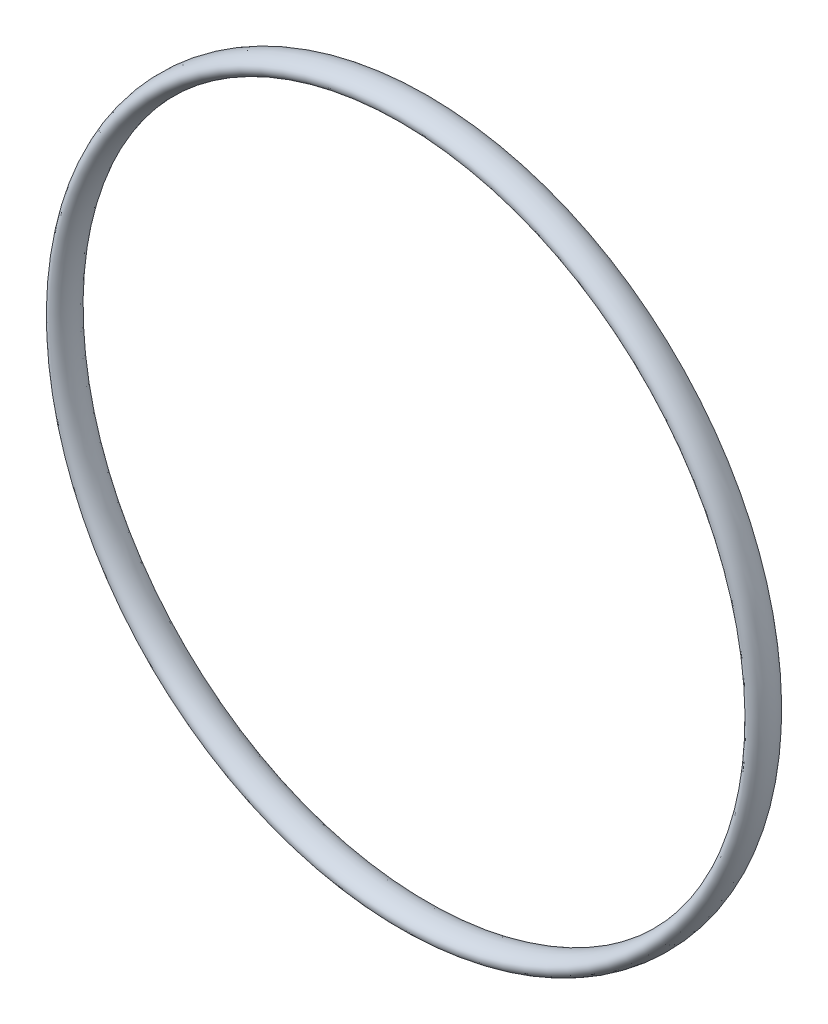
from build123d import *

# Parameters (mm, degrees)
ESQUISSE1_RX = 2.4
ESQUISSE1_RY = 1.45


with BuildPart() as part:
    # Esquisse1 → Base-R_volution (revolve)
    with BuildSketch(Plane(origin=(0, 0, 0), x_dir=(0, 0, -1), z_dir=(1, 0, 0))):
        with Locations(Location((2.4, 53.35), (0, 0, 180))):
            Ellipse(ESQUISSE1_RX, ESQUISSE1_RY)
    revolve(axis=Axis((0, 0, 0), (0, 0, -1)))


solid = part.part
